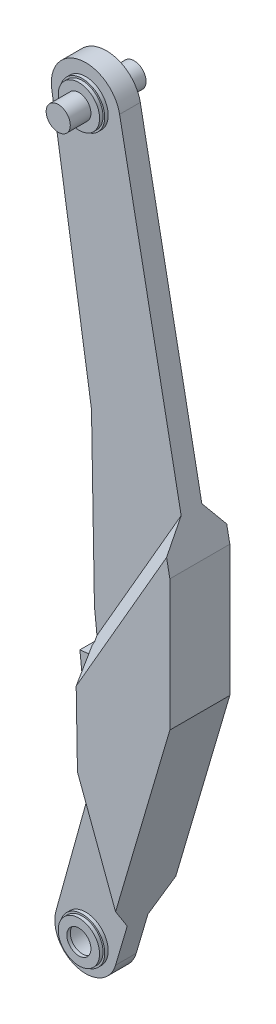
ISO-10303-21;
HEADER;
FILE_DESCRIPTION(('STEP AP214'),'2;1');
FILE_NAME('part.step','',(''),(''),'','','');
FILE_SCHEMA(('AUTOMOTIVE_DESIGN { 1 0 10303 214 1 1 1 1 }'));
ENDSEC;
DATA;
#1=APPLICATION_CONTEXT('core data for automotive mechanical design processes');
#2=APPLICATION_PROTOCOL_DEFINITION('international standard','automotive_design',2000,#1);
#3=PRODUCT_CONTEXT('',#1,'mechanical');
#4=PRODUCT('Part','Part','',(#3));
#5=PRODUCT_RELATED_PRODUCT_CATEGORY('part','',(#4));
#6=PRODUCT_DEFINITION_FORMATION('','',#4);
#7=PRODUCT_DEFINITION_CONTEXT('part definition',#1,'design');
#8=PRODUCT_DEFINITION('design','',#6,#7);
#9=PRODUCT_DEFINITION_SHAPE('','',#8);
#10=(LENGTH_UNIT() NAMED_UNIT(*) SI_UNIT(.MILLI.,.METRE.));
#11=(NAMED_UNIT(*) PLANE_ANGLE_UNIT() SI_UNIT($,.RADIAN.));
#12=(NAMED_UNIT(*) SI_UNIT($,.STERADIAN.) SOLID_ANGLE_UNIT());
#13=UNCERTAINTY_MEASURE_WITH_UNIT(LENGTH_MEASURE(1.E-05),#10,'distance_accuracy_value','');
#14=(GEOMETRIC_REPRESENTATION_CONTEXT(3) GLOBAL_UNCERTAINTY_ASSIGNED_CONTEXT((#13)) GLOBAL_UNIT_ASSIGNED_CONTEXT((#10,
#11,#12)) REPRESENTATION_CONTEXT('',''));
#15=CARTESIAN_POINT('',(0.,0.,0.));
#16=DIRECTION('',(0.,0.,1.));
#17=DIRECTION('',(1.,0.,0.));
#18=AXIS2_PLACEMENT_3D('',#15,#16,#17);
#19=CARTESIAN_POINT('',(30.4828677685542,252.569931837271,34.));
#20=DIRECTION('',(0.994521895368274,0.10452846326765,0.));
#21=DIRECTION('',(-0.10452846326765,0.994521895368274,0.));
#22=AXIS2_PLACEMENT_3D('',#19,#20,#21);
#23=PLANE('',#22);
#24=DIRECTION('',(0.10452846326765,-0.994521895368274,0.));
#25=VECTOR('',#24,1.);
#26=CARTESIAN_POINT('',(-52.7477110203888,1044.45599217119,0.));
#27=LINE('',#26,#25);
#28=CARTESIAN_POINT('',(12.5613807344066,423.081491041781,0.));
#29=VERTEX_POINT('',#28);
#30=CARTESIAN_POINT('',(16.2116507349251,388.351491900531,0.));
#31=VERTEX_POINT('',#30);
#32=EDGE_CURVE('E268',#29,#31,#27,.T.);
#33=ORIENTED_EDGE('',*,*,#32,.T.);
#34=DIRECTION('',(0.0856131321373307,-0.814554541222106,-0.573734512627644));
#35=VECTOR('',#34,1.);
#36=CARTESIAN_POINT('',(2.34765453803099,520.258604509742,92.9092640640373));
#37=LINE('',#36,#35);
#38=CARTESIAN_POINT('',(20.5390543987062,347.178996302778,-29.));
#39=VERTEX_POINT('',#38);
#40=EDGE_CURVE('E266',#31,#39,#37,.T.);
#41=ORIENTED_EDGE('',*,*,#40,.T.);
#42=DIRECTION('',(0.10452846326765,-0.994521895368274,0.));
#43=VECTOR('',#42,1.);
#44=CARTESIAN_POINT('',(30.4828677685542,252.569931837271,-29.));
#45=LINE('',#44,#43);
#46=CARTESIAN_POINT('',(30.4828677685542,252.569931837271,-29.));
#47=VERTEX_POINT('',#46);
#48=EDGE_CURVE('E244',#39,#47,#45,.T.);
#49=ORIENTED_EDGE('',*,*,#48,.T.);
#50=DIRECTION('',(0.,0.,-1.));
#51=VECTOR('',#50,1.);
#52=CARTESIAN_POINT('',(30.4828677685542,252.569931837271,34.));
#53=LINE('',#52,#51);
#54=CARTESIAN_POINT('',(30.4828677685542,252.569931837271,34.));
#55=VERTEX_POINT('',#54);
#56=EDGE_CURVE('E260',#55,#47,#53,.T.);
#57=ORIENTED_EDGE('',*,*,#56,.F.);
#58=DIRECTION('',(0.10452846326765,-0.994521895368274,0.));
#59=VECTOR('',#58,1.);
#60=CARTESIAN_POINT('',(30.4828677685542,252.569931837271,34.));
#61=LINE('',#60,#59);
#62=CARTESIAN_POINT('',(16.808533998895,382.672526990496,34.));
#63=VERTEX_POINT('',#62);
#64=EDGE_CURVE('E250',#63,#55,#61,.T.);
#65=ORIENTED_EDGE('',*,*,#64,.F.);
#66=DIRECTION('',(0.0856131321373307,-0.814554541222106,0.573734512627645));
#67=VECTOR('',#66,1.);
#68=CARTESIAN_POINT('',(17.641676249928,374.745707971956,39.583284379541));
#69=LINE('',#68,#67);
#70=CARTESIAN_POINT('',(16.2116507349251,388.351491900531,30.));
#71=VERTEX_POINT('',#70);
#72=EDGE_CURVE('E422',#63,#71,#69,.F.);
#73=ORIENTED_EDGE('',*,*,#72,.T.);
#74=DIRECTION('',(0.10452846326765,-0.994521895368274,0.));
#75=VECTOR('',#74,1.);
#76=CARTESIAN_POINT('',(-52.7477110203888,1044.45599217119,30.));
#77=LINE('',#76,#75);
#78=CARTESIAN_POINT('',(12.5613807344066,423.081491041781,30.));
#79=VERTEX_POINT('',#78);
#80=EDGE_CURVE('E259',#79,#71,#77,.T.);
#81=ORIENTED_EDGE('',*,*,#80,.F.);
#82=DIRECTION('',(0.,0.,-1.));
#83=VECTOR('',#82,1.);
#84=CARTESIAN_POINT('',(12.5613807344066,423.081491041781,34.));
#85=LINE('',#84,#83);
#86=EDGE_CURVE('E255',#79,#29,#85,.T.);
#87=ORIENTED_EDGE('',*,*,#86,.T.);
#88=EDGE_LOOP('',(#33,#41,#49,#57,#65,#73,#81,#87));
#89=FACE_BOUND('',#88,.T.);
#90=DIRECTION('',(-0.10452846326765,0.994521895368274,0.));
#91=VECTOR('',#90,1.);
#92=CARTESIAN_POINT('',(19.2983221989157,358.983774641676,28.));
#93=LINE('',#92,#91);
#94=CARTESIAN_POINT('',(29.7511685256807,259.531585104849,28.));
#95=VERTEX_POINT('',#94);
#96=CARTESIAN_POINT('',(19.2983221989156,358.983774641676,28.));
#97=VERTEX_POINT('',#96);
#98=EDGE_CURVE('E175',#95,#97,#93,.T.);
#99=ORIENTED_EDGE('',*,*,#98,.F.);
#100=DIRECTION('',(0.,0.,1.));
#101=VECTOR('',#100,1.);
#102=CARTESIAN_POINT('',(29.7511685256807,259.531585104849,28.));
#103=LINE('',#102,#101);
#104=CARTESIAN_POINT('',(29.7511685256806,259.531585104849,-12.));
#105=VERTEX_POINT('',#104);
#106=EDGE_CURVE('E177',#105,#95,#103,.T.);
#107=ORIENTED_EDGE('',*,*,#106,.F.);
#108=DIRECTION('',(0.10452846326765,-0.994521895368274,0.));
#109=VECTOR('',#108,1.);
#110=CARTESIAN_POINT('',(19.2983221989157,358.983774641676,-12.));
#111=LINE('',#110,#109);
#112=CARTESIAN_POINT('',(19.2983221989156,358.983774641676,-12.));
#113=VERTEX_POINT('',#112);
#114=EDGE_CURVE('E38',#113,#105,#111,.T.);
#115=ORIENTED_EDGE('',*,*,#114,.F.);
#116=DIRECTION('',(0.,0.,-1.));
#117=VECTOR('',#116,1.);
#118=CARTESIAN_POINT('',(19.2983221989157,358.983774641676,28.));
#119=LINE('',#118,#117);
#120=EDGE_CURVE('E33',#97,#113,#119,.T.);
#121=ORIENTED_EDGE('',*,*,#120,.F.);
#122=EDGE_LOOP('',(#99,#107,#115,#121));
#123=FACE_BOUND('',#122,.T.);
#124=ADVANCED_FACE('F16',(#89,#123),#23,.F.);
#125=CARTESIAN_POINT('',(0.,0.,-5.));
#126=DIRECTION('',(0.,0.,1.));
#127=DIRECTION('',(1.,0.,0.));
#128=AXIS2_PLACEMENT_3D('',#125,#126,#127);
#129=PLANE('',#128);
#130=CARTESIAN_POINT('',(0.,0.,-5.));
#131=DIRECTION('',(0.,0.,1.));
#132=DIRECTION('',(1.,0.,0.));
#133=AXIS2_PLACEMENT_3D('',#130,#131,#132);
#134=CIRCLE('',#133,32.5);
#135=CARTESIAN_POINT('',(32.5,0.,-5.));
#136=VERTEX_POINT('',#135);
#137=EDGE_CURVE('E307',#136,#136,#134,.T.);
#138=ORIENTED_EDGE('',*,*,#137,.F.);
#139=EDGE_LOOP('',(#138));
#140=FACE_BOUND('',#139,.T.);
#141=CARTESIAN_POINT('',(0.,0.,-5.));
#142=DIRECTION('',(0.,0.,1.));
#143=DIRECTION('',(1.,0.,0.));
#144=AXIS2_PLACEMENT_3D('',#141,#142,#143);
#145=CIRCLE('',#144,30.);
#146=CARTESIAN_POINT('',(30.,0.,-5.));
#147=VERTEX_POINT('',#146);
#148=EDGE_CURVE('E10',#147,#147,#145,.F.);
#149=ORIENTED_EDGE('',*,*,#148,.F.);
#150=EDGE_LOOP('',(#149));
#151=FACE_BOUND('',#150,.T.);
#152=ADVANCED_FACE('F450',(#140,#151),#129,.F.);
#153=CARTESIAN_POINT('',(0.,0.,35.));
#154=DIRECTION('',(0.,0.,1.));
#155=DIRECTION('',(1.,0.,0.));
#156=AXIS2_PLACEMENT_3D('',#153,#154,#155);
#157=PLANE('',#156);
#158=CARTESIAN_POINT('',(0.,0.,35.));
#159=DIRECTION('',(0.,0.,1.));
#160=DIRECTION('',(1.,0.,0.));
#161=AXIS2_PLACEMENT_3D('',#158,#159,#160);
#162=CIRCLE('',#161,32.5);
#163=CARTESIAN_POINT('',(32.5,0.,35.));
#164=VERTEX_POINT('',#163);
#165=EDGE_CURVE('E310',#164,#164,#162,.T.);
#166=ORIENTED_EDGE('',*,*,#165,.T.);
#167=EDGE_LOOP('',(#166));
#168=FACE_BOUND('',#167,.T.);
#169=CARTESIAN_POINT('',(0.,0.,35.));
#170=DIRECTION('',(0.,0.,1.));
#171=DIRECTION('',(1.,0.,0.));
#172=AXIS2_PLACEMENT_3D('',#169,#170,#171);
#173=CIRCLE('',#172,30.);
#174=CARTESIAN_POINT('',(30.,0.,35.));
#175=VERTEX_POINT('',#174);
#176=EDGE_CURVE('E211',#175,#175,#173,.T.);
#177=ORIENTED_EDGE('',*,*,#176,.F.);
#178=EDGE_LOOP('',(#177));
#179=FACE_BOUND('',#178,.T.);
#180=ADVANCED_FACE('F443',(#168,#179),#157,.T.);
#181=CARTESIAN_POINT('',(0.,1050.,-10.));
#182=DIRECTION('',(0.,0.,-1.));
#183=DIRECTION('',(-1.,0.,0.));
#184=AXIS2_PLACEMENT_3D('',#181,#182,#183);
#185=PLANE('',#184);
#186=CARTESIAN_POINT('',(0.,1050.,-10.));
#187=DIRECTION('',(0.,0.,-1.));
#188=DIRECTION('',(-1.,0.,0.));
#189=AXIS2_PLACEMENT_3D('',#186,#187,#188);
#190=CIRCLE('',#189,30.);
#191=CARTESIAN_POINT('',(-30.,1050.,-10.));
#192=VERTEX_POINT('',#191);
#193=EDGE_CURVE('E226',#192,#192,#190,.T.);
#194=ORIENTED_EDGE('',*,*,#193,.T.);
#195=EDGE_LOOP('',(#194));
#196=FACE_BOUND('',#195,.T.);
#197=CARTESIAN_POINT('',(0.,1050.,-10.));
#198=DIRECTION('',(0.,0.,-1.));
#199=DIRECTION('',(-1.,0.,0.));
#200=AXIS2_PLACEMENT_3D('',#197,#198,#199);
#201=CIRCLE('',#200,17.5);
#202=CARTESIAN_POINT('',(-17.5,1050.,-10.));
#203=VERTEX_POINT('',#202);
#204=EDGE_CURVE('E220',#203,#203,#201,.T.);
#205=ORIENTED_EDGE('',*,*,#204,.F.);
#206=EDGE_LOOP('',(#205));
#207=FACE_BOUND('',#206,.T.);
#208=ADVANCED_FACE('F432',(#196,#207),#185,.T.);
#209=CARTESIAN_POINT('',(0.,1050.,-5.));
#210=DIRECTION('',(0.,0.,1.));
#211=DIRECTION('',(1.,0.,0.));
#212=AXIS2_PLACEMENT_3D('',#209,#210,#211);
#213=PLANE('',#212);
#214=CARTESIAN_POINT('',(0.,1050.,-5.));
#215=DIRECTION('',(0.,0.,1.));
#216=DIRECTION('',(1.,0.,0.));
#217=AXIS2_PLACEMENT_3D('',#214,#215,#216);
#218=CIRCLE('',#217,32.5);
#219=CARTESIAN_POINT('',(32.5,1050.,-5.));
#220=VERTEX_POINT('',#219);
#221=EDGE_CURVE('E322',#220,#220,#218,.T.);
#222=ORIENTED_EDGE('',*,*,#221,.F.);
#223=EDGE_LOOP('',(#222));
#224=FACE_BOUND('',#223,.T.);
#225=CARTESIAN_POINT('',(0.,1050.,-5.));
#226=DIRECTION('',(0.,0.,1.));
#227=DIRECTION('',(1.,0.,0.));
#228=AXIS2_PLACEMENT_3D('',#225,#226,#227);
#229=CIRCLE('',#228,30.);
#230=CARTESIAN_POINT('',(30.,1050.,-5.));
#231=VERTEX_POINT('',#230);
#232=EDGE_CURVE('E26',#231,#231,#229,.F.);
#233=ORIENTED_EDGE('',*,*,#232,.F.);
#234=EDGE_LOOP('',(#233));
#235=FACE_BOUND('',#234,.T.);
#236=ADVANCED_FACE('F429',(#224,#235),#213,.F.);
#237=CARTESIAN_POINT('',(0.,1050.,40.));
#238=DIRECTION('',(0.,0.,1.));
#239=DIRECTION('',(1.,0.,0.));
#240=AXIS2_PLACEMENT_3D('',#237,#238,#239);
#241=PLANE('',#240);
#242=CARTESIAN_POINT('',(0.,1050.,40.));
#243=DIRECTION('',(0.,0.,1.));
#244=DIRECTION('',(1.,0.,0.));
#245=AXIS2_PLACEMENT_3D('',#242,#243,#244);
#246=CIRCLE('',#245,30.);
#247=CARTESIAN_POINT('',(30.,1050.,40.));
#248=VERTEX_POINT('',#247);
#249=EDGE_CURVE('E238',#248,#248,#246,.T.);
#250=ORIENTED_EDGE('',*,*,#249,.T.);
#251=EDGE_LOOP('',(#250));
#252=FACE_BOUND('',#251,.T.);
#253=CARTESIAN_POINT('',(0.,1050.,40.));
#254=DIRECTION('',(0.,0.,1.));
#255=DIRECTION('',(1.,0.,0.));
#256=AXIS2_PLACEMENT_3D('',#253,#254,#255);
#257=CIRCLE('',#256,17.5);
#258=CARTESIAN_POINT('',(17.5,1050.,40.));
#259=VERTEX_POINT('',#258);
#260=EDGE_CURVE('E229',#259,#259,#257,.T.);
#261=ORIENTED_EDGE('',*,*,#260,.F.);
#262=EDGE_LOOP('',(#261));
#263=FACE_BOUND('',#262,.T.);
#264=ADVANCED_FACE('F431',(#252,#263),#241,.T.);
#265=CARTESIAN_POINT('',(0.,1050.,35.));
#266=DIRECTION('',(0.,0.,1.));
#267=DIRECTION('',(1.,0.,0.));
#268=AXIS2_PLACEMENT_3D('',#265,#266,#267);
#269=PLANE('',#268);
#270=CARTESIAN_POINT('',(0.,1050.,35.));
#271=DIRECTION('',(0.,0.,1.));
#272=DIRECTION('',(1.,0.,0.));
#273=AXIS2_PLACEMENT_3D('',#270,#271,#272);
#274=CIRCLE('',#273,32.5);
#275=CARTESIAN_POINT('',(32.5,1050.,35.));
#276=VERTEX_POINT('',#275);
#277=EDGE_CURVE('E325',#276,#276,#274,.T.);
#278=ORIENTED_EDGE('',*,*,#277,.T.);
#279=EDGE_LOOP('',(#278));
#280=FACE_BOUND('',#279,.T.);
#281=CARTESIAN_POINT('',(0.,1050.,35.));
#282=DIRECTION('',(0.,0.,1.));
#283=DIRECTION('',(1.,0.,0.));
#284=AXIS2_PLACEMENT_3D('',#281,#282,#283);
#285=CIRCLE('',#284,30.);
#286=CARTESIAN_POINT('',(30.,1050.,35.));
#287=VERTEX_POINT('',#286);
#288=EDGE_CURVE('E235',#287,#287,#285,.T.);
#289=ORIENTED_EDGE('',*,*,#288,.F.);
#290=EDGE_LOOP('',(#289));
#291=FACE_BOUND('',#290,.T.);
#292=ADVANCED_FACE('F440',(#280,#291),#269,.T.);
#293=CARTESIAN_POINT('',(8.27747138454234,668.506493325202,30.));
#294=DIRECTION('',(0.999847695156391,0.0174524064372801,0.));
#295=DIRECTION('',(-0.0174524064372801,0.999847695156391,0.));
#296=AXIS2_PLACEMENT_3D('',#293,#294,#295);
#297=PLANE('',#296);
#298=DIRECTION('',(0.0174524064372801,-0.999847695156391,0.));
#299=VECTOR('',#298,1.);
#300=CARTESIAN_POINT('',(8.27747138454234,668.506493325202,0.));
#301=LINE('',#300,#299);
#302=CARTESIAN_POINT('',(8.27747138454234,668.506493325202,0.));
#303=VERTEX_POINT('',#302);
#304=EDGE_CURVE('E337',#303,#29,#301,.T.);
#305=ORIENTED_EDGE('',*,*,#304,.T.);
#306=ORIENTED_EDGE('',*,*,#86,.F.);
#307=DIRECTION('',(0.0174524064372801,-0.999847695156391,0.));
#308=VECTOR('',#307,1.);
#309=CARTESIAN_POINT('',(8.27747138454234,668.506493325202,30.));
#310=LINE('',#309,#308);
#311=CARTESIAN_POINT('',(8.27747138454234,668.506493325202,30.));
#312=VERTEX_POINT('',#311);
#313=EDGE_CURVE('E354',#312,#79,#310,.T.);
#314=ORIENTED_EDGE('',*,*,#313,.F.);
#315=DIRECTION('',(0.,0.,-1.));
#316=VECTOR('',#315,1.);
#317=CARTESIAN_POINT('',(8.27747138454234,668.506493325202,30.));
#318=LINE('',#317,#316);
#319=EDGE_CURVE('E377',#312,#303,#318,.T.);
#320=ORIENTED_EDGE('',*,*,#319,.T.);
#321=EDGE_LOOP('',(#305,#306,#314,#320));
#322=FACE_BOUND('',#321,.T.);
#323=ADVANCED_FACE('F605',(#322),#297,.F.);
#324=CARTESIAN_POINT('',(0.,1050.,30.));
#325=DIRECTION('',(0.,0.,-1.));
#326=DIRECTION('',(-1.,0.,0.));
#327=AXIS2_PLACEMENT_3D('',#324,#325,#326);
#328=PLANE('',#327);
#329=CARTESIAN_POINT('',(0.,0.,30.));
#330=DIRECTION('',(0.,0.,-1.));
#331=DIRECTION('',(-1.,0.,0.));
#332=AXIS2_PLACEMENT_3D('',#329,#330,#331);
#333=CIRCLE('',#332,32.5);
#334=CARTESIAN_POINT('',(-32.5,0.,30.));
#335=VERTEX_POINT('',#334);
#336=EDGE_CURVE('E314',#335,#335,#333,.F.);
#337=ORIENTED_EDGE('',*,*,#336,.F.);
#338=EDGE_LOOP('',(#337));
#339=FACE_BOUND('',#338,.T.);
#340=DIRECTION('',(0.282341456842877,0.959313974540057,0.));
#341=VECTOR('',#340,1.);
#342=CARTESIAN_POINT('',(172.2522140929,425.881333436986,30.));
#343=LINE('',#342,#341);
#344=CARTESIAN_POINT('',(43.1691288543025,-12.7053655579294,30.));
#345=VERTEX_POINT('',#344);
#346=CARTESIAN_POINT('',(60.1527415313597,45.,30.));
#347=VERTEX_POINT('',#346);
#348=EDGE_CURVE('E361',#345,#347,#343,.T.);
#349=ORIENTED_EDGE('',*,*,#348,.T.);
#350=DIRECTION('',(-0.349902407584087,0.936786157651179,0.));
#351=VECTOR('',#350,1.);
#352=CARTESIAN_POINT('',(-276.634511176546,946.673236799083,30.));
#353=LINE('',#352,#351);
#354=CARTESIAN_POINT('',(5.99326374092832,190.,30.));
#355=VERTEX_POINT('',#354);
#356=EDGE_CURVE('E302',#347,#355,#353,.T.);
#357=ORIENTED_EDGE('',*,*,#356,.T.);
#358=DIRECTION('',(-0.267238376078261,-0.963630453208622,0.));
#359=VECTOR('',#358,1.);
#360=CARTESIAN_POINT('',(16.,226.083125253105,30.));
#361=LINE('',#360,#359);
#362=CARTESIAN_POINT('',(-43.3633703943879,12.0257269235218,30.));
#363=VERTEX_POINT('',#362);
#364=EDGE_CURVE('E357',#355,#363,#361,.T.);
#365=ORIENTED_EDGE('',*,*,#364,.T.);
#366=CARTESIAN_POINT('',(0.,0.,30.));
#367=DIRECTION('',(0.,0.,1.));
#368=DIRECTION('',(1.,0.,0.));
#369=AXIS2_PLACEMENT_3D('',#366,#367,#368);
#370=CIRCLE('',#369,45.);
#371=EDGE_CURVE('E359',#363,#345,#370,.T.);
#372=ORIENTED_EDGE('',*,*,#371,.T.);
#373=EDGE_LOOP('',(#349,#357,#365,#372));
#374=FACE_BOUND('',#373,.T.);
#375=ADVANCED_FACE('F638',(#339,#374),#328,.F.);
#376=CARTESIAN_POINT('',(0.,1050.,0.));
#377=DIRECTION('',(0.,0.,-1.));
#378=DIRECTION('',(-1.,0.,0.));
#379=AXIS2_PLACEMENT_3D('',#376,#377,#378);
#380=PLANE('',#379);
#381=DIRECTION('',(-0.349902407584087,0.936786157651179,0.));
#382=VECTOR('',#381,1.);
#383=CARTESIAN_POINT('',(-276.634511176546,946.673236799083,0.));
#384=LINE('',#383,#382);
#385=CARTESIAN_POINT('',(60.1527415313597,45.,0.));
#386=VERTEX_POINT('',#385);
#387=CARTESIAN_POINT('',(5.99326374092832,190.,0.));
#388=VERTEX_POINT('',#387);
#389=EDGE_CURVE('E299',#386,#388,#384,.T.);
#390=ORIENTED_EDGE('',*,*,#389,.F.);
#391=DIRECTION('',(0.282341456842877,0.959313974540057,0.));
#392=VECTOR('',#391,1.);
#393=CARTESIAN_POINT('',(172.2522140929,425.881333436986,0.));
#394=LINE('',#393,#392);
#395=CARTESIAN_POINT('',(43.1691288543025,-12.7053655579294,0.));
#396=VERTEX_POINT('',#395);
#397=EDGE_CURVE('E344',#396,#386,#394,.T.);
#398=ORIENTED_EDGE('',*,*,#397,.F.);
#399=CARTESIAN_POINT('',(0.,0.,0.));
#400=DIRECTION('',(0.,0.,1.));
#401=DIRECTION('',(1.,0.,0.));
#402=AXIS2_PLACEMENT_3D('',#399,#400,#401);
#403=CIRCLE('',#402,45.);
#404=CARTESIAN_POINT('',(-43.3633703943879,12.0257269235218,0.));
#405=VERTEX_POINT('',#404);
#406=EDGE_CURVE('E342',#405,#396,#403,.T.);
#407=ORIENTED_EDGE('',*,*,#406,.F.);
#408=DIRECTION('',(-0.267238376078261,-0.963630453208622,0.));
#409=VECTOR('',#408,1.);
#410=CARTESIAN_POINT('',(16.,226.083125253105,0.));
#411=LINE('',#410,#409);
#412=EDGE_CURVE('E340',#388,#405,#411,.T.);
#413=ORIENTED_EDGE('',*,*,#412,.F.);
#414=EDGE_LOOP('',(#390,#398,#407,#413));
#415=FACE_BOUND('',#414,.T.);
#416=CARTESIAN_POINT('',(0.,0.,0.));
#417=DIRECTION('',(0.,0.,-1.));
#418=DIRECTION('',(-1.,0.,0.));
#419=AXIS2_PLACEMENT_3D('',#416,#417,#418);
#420=CIRCLE('',#419,32.5);
#421=CARTESIAN_POINT('',(-32.5,0.,0.));
#422=VERTEX_POINT('',#421);
#423=EDGE_CURVE('E313',#422,#422,#420,.F.);
#424=ORIENTED_EDGE('',*,*,#423,.T.);
#425=EDGE_LOOP('',(#424));
#426=FACE_BOUND('',#425,.T.);
#427=ADVANCED_FACE('F648',(#415,#426),#380,.T.);
#428=CARTESIAN_POINT('',(0.,1050.,30.));
#429=DIRECTION('',(0.,0.,-1.));
#430=DIRECTION('',(-1.,0.,0.));
#431=AXIS2_PLACEMENT_3D('',#428,#429,#430);
#432=CIRCLE('',#431,32.5);
#433=CARTESIAN_POINT('',(-32.5,1050.,30.));
#434=VERTEX_POINT('',#433);
#435=EDGE_CURVE('E318',#434,#434,#432,.F.);
#436=ORIENTED_EDGE('',*,*,#435,.F.);
#437=EDGE_LOOP('',(#436));
#438=FACE_BOUND('',#437,.T.);
#439=ORIENTED_EDGE('',*,*,#313,.T.);
#440=ORIENTED_EDGE('',*,*,#80,.T.);
#441=DIRECTION('',(0.5,0.866025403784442,0.));
#442=VECTOR('',#441,1.);
#443=CARTESIAN_POINT('',(298.660946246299,877.568022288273,30.));
#444=LINE('',#443,#442);
#445=CARTESIAN_POINT('',(138.406973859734,600.,30.));
#446=VERTEX_POINT('',#445);
#447=EDGE_CURVE('E297',#71,#446,#444,.T.);
#448=ORIENTED_EDGE('',*,*,#447,.T.);
#449=DIRECTION('',(-0.190808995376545,0.981627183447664,0.));
#450=VECTOR('',#449,1.);
#451=CARTESIAN_POINT('',(49.0813591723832,1059.54044976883,30.));
#452=LINE('',#451,#450);
#453=CARTESIAN_POINT('',(49.0813591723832,1059.54044976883,30.));
#454=VERTEX_POINT('',#453);
#455=EDGE_CURVE('E364',#446,#454,#452,.T.);
#456=ORIENTED_EDGE('',*,*,#455,.T.);
#457=CARTESIAN_POINT('',(0.,1050.,30.));
#458=DIRECTION('',(0.,0.,1.));
#459=DIRECTION('',(-1.,0.,0.));
#460=AXIS2_PLACEMENT_3D('',#457,#458,#459);
#461=CIRCLE('',#460,50.);
#462=CARTESIAN_POINT('',(-49.4151151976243,1042.37462197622,30.));
#463=VERTEX_POINT('',#462);
#464=EDGE_CURVE('E349',#454,#463,#461,.T.);
#465=ORIENTED_EDGE('',*,*,#464,.T.);
#466=DIRECTION('',(0.15250756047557,-0.988302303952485,0.));
#467=VECTOR('',#466,1.);
#468=CARTESIAN_POINT('',(-49.4151151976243,1042.37462197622,30.));
#469=LINE('',#468,#467);
#470=EDGE_CURVE('E352',#463,#312,#469,.T.);
#471=ORIENTED_EDGE('',*,*,#470,.T.);
#472=EDGE_LOOP('',(#439,#440,#448,#456,#465,#471));
#473=FACE_BOUND('',#472,.T.);
#474=ADVANCED_FACE('F588',(#438,#473),#328,.F.);
#475=ORIENTED_EDGE('',*,*,#32,.F.);
#476=ORIENTED_EDGE('',*,*,#304,.F.);
#477=DIRECTION('',(0.15250756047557,-0.988302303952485,0.));
#478=VECTOR('',#477,1.);
#479=CARTESIAN_POINT('',(-49.4151151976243,1042.37462197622,0.));
#480=LINE('',#479,#478);
#481=CARTESIAN_POINT('',(-49.4151151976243,1042.37462197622,0.));
#482=VERTEX_POINT('',#481);
#483=EDGE_CURVE('E335',#482,#303,#480,.T.);
#484=ORIENTED_EDGE('',*,*,#483,.F.);
#485=CARTESIAN_POINT('',(0.,1050.,0.));
#486=DIRECTION('',(0.,0.,1.));
#487=DIRECTION('',(-1.,0.,0.));
#488=AXIS2_PLACEMENT_3D('',#485,#486,#487);
#489=CIRCLE('',#488,50.);
#490=CARTESIAN_POINT('',(49.0813591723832,1059.54044976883,0.));
#491=VERTEX_POINT('',#490);
#492=EDGE_CURVE('E332',#491,#482,#489,.T.);
#493=ORIENTED_EDGE('',*,*,#492,.F.);
#494=DIRECTION('',(-0.190808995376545,0.981627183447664,0.));
#495=VECTOR('',#494,1.);
#496=CARTESIAN_POINT('',(49.0813591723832,1059.54044976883,0.));
#497=LINE('',#496,#495);
#498=CARTESIAN_POINT('',(138.406973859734,600.,0.));
#499=VERTEX_POINT('',#498);
#500=EDGE_CURVE('E347',#499,#491,#497,.T.);
#501=ORIENTED_EDGE('',*,*,#500,.F.);
#502=DIRECTION('',(0.5,0.866025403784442,0.));
#503=VECTOR('',#502,1.);
#504=CARTESIAN_POINT('',(298.660946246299,877.568022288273,0.));
#505=LINE('',#504,#503);
#506=EDGE_CURVE('E295',#31,#499,#505,.T.);
#507=ORIENTED_EDGE('',*,*,#506,.F.);
#508=EDGE_LOOP('',(#475,#476,#484,#493,#501,#507));
#509=FACE_BOUND('',#508,.T.);
#510=CARTESIAN_POINT('',(0.,1050.,0.));
#511=DIRECTION('',(0.,0.,-1.));
#512=DIRECTION('',(-1.,0.,0.));
#513=AXIS2_PLACEMENT_3D('',#510,#511,#512);
#514=CIRCLE('',#513,32.5);
#515=CARTESIAN_POINT('',(-32.5,1050.,0.));
#516=VERTEX_POINT('',#515);
#517=EDGE_CURVE('E328',#516,#516,#514,.F.);
#518=ORIENTED_EDGE('',*,*,#517,.T.);
#519=EDGE_LOOP('',(#518));
#520=FACE_BOUND('',#519,.T.);
#521=ADVANCED_FACE('F610',(#509,#520),#380,.T.);
#522=CARTESIAN_POINT('',(0.,1050.,30.));
#523=DIRECTION('',(0.,0.,-1.));
#524=DIRECTION('',(-1.,0.,0.));
#525=AXIS2_PLACEMENT_3D('',#522,#523,#524);
#526=CYLINDRICAL_SURFACE('',#525,50.);
#527=ORIENTED_EDGE('',*,*,#492,.T.);
#528=DIRECTION('',(0.,0.,-1.));
#529=VECTOR('',#528,1.);
#530=CARTESIAN_POINT('',(-49.4151151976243,1042.37462197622,30.));
#531=LINE('',#530,#529);
#532=EDGE_CURVE('E331',#463,#482,#531,.T.);
#533=ORIENTED_EDGE('',*,*,#532,.F.);
#534=ORIENTED_EDGE('',*,*,#464,.F.);
#535=DIRECTION('',(0.,0.,-1.));
#536=VECTOR('',#535,1.);
#537=CARTESIAN_POINT('',(49.0813591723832,1059.54044976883,30.));
#538=LINE('',#537,#536);
#539=EDGE_CURVE('E366',#454,#491,#538,.T.);
#540=ORIENTED_EDGE('',*,*,#539,.T.);
#541=EDGE_LOOP('',(#527,#533,#534,#540));
#542=FACE_BOUND('',#541,.T.);
#543=ADVANCED_FACE('F18',(#542),#526,.T.);
#544=CARTESIAN_POINT('',(-49.4151151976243,1042.37462197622,30.));
#545=DIRECTION('',(0.988302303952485,0.15250756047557,0.));
#546=DIRECTION('',(-0.15250756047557,0.988302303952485,0.));
#547=AXIS2_PLACEMENT_3D('',#544,#545,#546);
#548=PLANE('',#547);
#549=ORIENTED_EDGE('',*,*,#483,.T.);
#550=ORIENTED_EDGE('',*,*,#319,.F.);
#551=ORIENTED_EDGE('',*,*,#470,.F.);
#552=ORIENTED_EDGE('',*,*,#532,.T.);
#553=EDGE_LOOP('',(#549,#550,#551,#552));
#554=FACE_BOUND('',#553,.T.);
#555=ADVANCED_FACE('F601',(#554),#548,.F.);
#556=DIRECTION('',(-0.0174524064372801,0.999847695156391,0.));
#557=VECTOR('',#556,1.);
#558=CARTESIAN_POINT('',(15.8638940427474,233.880630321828,34.));
#559=LINE('',#558,#557);
#560=CARTESIAN_POINT('',(15.8638940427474,233.880630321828,34.));
#561=VERTEX_POINT('',#560);
#562=CARTESIAN_POINT('',(13.3706592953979,376.717953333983,34.));
#563=VERTEX_POINT('',#562);
#564=EDGE_CURVE('E248',#561,#563,#559,.T.);
#565=ORIENTED_EDGE('',*,*,#564,.F.);
#566=DIRECTION('',(0.,0.,-1.));
#567=VECTOR('',#566,1.);
#568=CARTESIAN_POINT('',(15.8638940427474,233.880630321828,34.));
#569=LINE('',#568,#567);
#570=CARTESIAN_POINT('',(15.8638940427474,233.880630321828,-29.));
#571=VERTEX_POINT('',#570);
#572=EDGE_CURVE('E256',#561,#571,#569,.T.);
#573=ORIENTED_EDGE('',*,*,#572,.T.);
#574=DIRECTION('',(0.0174524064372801,-0.999847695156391,0.));
#575=VECTOR('',#574,1.);
#576=CARTESIAN_POINT('',(13.2569255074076,383.233757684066,-29.));
#577=LINE('',#576,#575);
#578=CARTESIAN_POINT('',(15.8778517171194,233.080995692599,-29.));
#579=VERTEX_POINT('',#578);
#580=EDGE_CURVE('E290',#571,#579,#577,.T.);
#581=ORIENTED_EDGE('',*,*,#580,.T.);
#582=DIRECTION('',(0.0162183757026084,-0.929150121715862,0.369346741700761));
#583=VECTOR('',#582,1.);
#584=CARTESIAN_POINT('',(18.8974635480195,60.0875497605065,39.7666762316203));
#585=LINE('',#584,#583);
#586=CARTESIAN_POINT('',(16.,226.083125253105,-26.2182744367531));
#587=VERTEX_POINT('',#586);
#588=EDGE_CURVE('E317',#579,#587,#585,.T.);
#589=ORIENTED_EDGE('',*,*,#588,.T.);
#590=DIRECTION('',(0.,0.,-1.));
#591=VECTOR('',#590,1.);
#592=CARTESIAN_POINT('',(16.,226.083125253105,30.));
#593=LINE('',#592,#591);
#594=CARTESIAN_POINT('',(16.,226.083125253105,56.2182744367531));
#595=VERTEX_POINT('',#594);
#596=EDGE_CURVE('E375',#595,#587,#593,.T.);
#597=ORIENTED_EDGE('',*,*,#596,.F.);
#598=DIRECTION('',(0.0162183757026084,-0.929150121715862,-0.369346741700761));
#599=VECTOR('',#598,1.);
#600=CARTESIAN_POINT('',(12.9478287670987,400.941898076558,125.726437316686));
#601=LINE('',#600,#599);
#602=CARTESIAN_POINT('',(15.9217626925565,230.565337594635,58.));
#603=VERTEX_POINT('',#602);
#604=EDGE_CURVE('E406',#595,#603,#601,.F.);
#605=ORIENTED_EDGE('',*,*,#604,.T.);
#606=DIRECTION('',(0.0174524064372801,-0.999847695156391,0.));
#607=VECTOR('',#606,1.);
#608=CARTESIAN_POINT('',(13.2569255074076,383.233757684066,58.));
#609=LINE('',#608,#607);
#610=CARTESIAN_POINT('',(14.0530620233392,337.623127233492,58.));
#611=VERTEX_POINT('',#610);
#612=EDGE_CURVE('E281',#611,#603,#609,.T.);
#613=ORIENTED_EDGE('',*,*,#612,.F.);
#614=DIRECTION('',(0.0148740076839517,-0.852131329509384,0.523116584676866));
#615=VECTOR('',#614,1.);
#616=CARTESIAN_POINT('',(13.3889667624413,375.669119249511,34.6438708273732));
#617=LINE('',#616,#615);
#618=EDGE_CURVE('E408',#611,#563,#617,.F.);
#619=ORIENTED_EDGE('',*,*,#618,.T.);
#620=EDGE_LOOP('',(#565,#573,#581,#589,#597,#605,#613,#619));
#621=FACE_BOUND('',#620,.T.);
#622=ADVANCED_FACE('F620',(#621),#297,.F.);
#623=CARTESIAN_POINT('',(16.,226.083125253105,30.));
#624=DIRECTION('',(0.963630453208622,-0.267238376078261,0.));
#625=DIRECTION('',(0.267238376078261,0.963630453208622,0.));
#626=AXIS2_PLACEMENT_3D('',#623,#624,#625);
#627=PLANE('',#626);
#628=ORIENTED_EDGE('',*,*,#364,.F.);
#629=DIRECTION('',(-0.21891156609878,-0.789369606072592,-0.573561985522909));
#630=VECTOR('',#629,1.);
#631=CARTESIAN_POINT('',(47.3665592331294,339.187283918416,138.400620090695));
#632=LINE('',#631,#630);
#633=EDGE_CURVE('E416',#355,#595,#632,.F.);
#634=ORIENTED_EDGE('',*,*,#633,.T.);
#635=ORIENTED_EDGE('',*,*,#596,.T.);
#636=DIRECTION('',(-0.21891156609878,-0.789369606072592,0.573561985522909));
#637=VECTOR('',#636,1.);
#638=CARTESIAN_POINT('',(-16.4676007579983,109.008739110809,58.8488688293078));
#639=LINE('',#638,#637);
#640=EDGE_CURVE('E398',#587,#388,#639,.T.);
#641=ORIENTED_EDGE('',*,*,#640,.T.);
#642=ORIENTED_EDGE('',*,*,#412,.T.);
#643=DIRECTION('',(0.,0.,-1.));
#644=VECTOR('',#643,1.);
#645=CARTESIAN_POINT('',(-43.3633703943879,12.0257269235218,30.));
#646=LINE('',#645,#644);
#647=EDGE_CURVE('E372',#363,#405,#646,.T.);
#648=ORIENTED_EDGE('',*,*,#647,.F.);
#649=EDGE_LOOP('',(#628,#634,#635,#641,#642,#648));
#650=FACE_BOUND('',#649,.T.);
#651=ADVANCED_FACE('F651',(#650),#627,.F.);
#652=CARTESIAN_POINT('',(0.,0.,30.));
#653=DIRECTION('',(0.,0.,-1.));
#654=DIRECTION('',(-1.,0.,0.));
#655=AXIS2_PLACEMENT_3D('',#652,#653,#654);
#656=CYLINDRICAL_SURFACE('',#655,45.);
#657=ORIENTED_EDGE('',*,*,#406,.T.);
#658=DIRECTION('',(0.,0.,-1.));
#659=VECTOR('',#658,1.);
#660=CARTESIAN_POINT('',(43.1691288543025,-12.7053655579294,30.));
#661=LINE('',#660,#659);
#662=EDGE_CURVE('E369',#345,#396,#661,.T.);
#663=ORIENTED_EDGE('',*,*,#662,.F.);
#664=ORIENTED_EDGE('',*,*,#371,.F.);
#665=ORIENTED_EDGE('',*,*,#647,.T.);
#666=EDGE_LOOP('',(#657,#663,#664,#665));
#667=FACE_BOUND('',#666,.T.);
#668=ADVANCED_FACE('F644',(#667),#656,.T.);
#669=CARTESIAN_POINT('',(172.2522140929,425.881333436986,30.));
#670=DIRECTION('',(-0.959313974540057,0.282341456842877,0.));
#671=DIRECTION('',(-0.282341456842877,-0.959313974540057,0.));
#672=AXIS2_PLACEMENT_3D('',#669,#670,#671);
#673=PLANE('',#672);
#674=DIRECTION('',(0.282341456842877,0.959313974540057,0.));
#675=VECTOR('',#674,1.);
#676=CARTESIAN_POINT('',(60.1527415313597,45.,-29.));
#677=LINE('',#676,#675);
#678=CARTESIAN_POINT('',(71.6004681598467,83.8960383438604,-29.));
#679=VERTEX_POINT('',#678);
#680=CARTESIAN_POINT('',(150.,350.274795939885,-29.));
#681=VERTEX_POINT('',#680);
#682=EDGE_CURVE('E292',#679,#681,#677,.T.);
#683=ORIENTED_EDGE('',*,*,#682,.T.);
#684=DIRECTION('',(0.,0.,1.));
#685=VECTOR('',#684,1.);
#686=CARTESIAN_POINT('',(150.,350.274795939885,30.));
#687=LINE('',#686,#685);
#688=CARTESIAN_POINT('',(150.,350.274795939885,58.));
#689=VERTEX_POINT('',#688);
#690=EDGE_CURVE('E276',#681,#689,#687,.T.);
#691=ORIENTED_EDGE('',*,*,#690,.T.);
#692=DIRECTION('',(0.282341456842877,0.959313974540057,0.));
#693=VECTOR('',#692,1.);
#694=CARTESIAN_POINT('',(60.1527415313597,45.,58.));
#695=LINE('',#694,#693);
#696=CARTESIAN_POINT('',(71.205718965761,82.5547956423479,58.));
#697=VERTEX_POINT('',#696);
#698=EDGE_CURVE('E284',#697,#689,#695,.T.);
#699=ORIENTED_EDGE('',*,*,#698,.F.);
#700=DIRECTION('',(0.229646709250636,0.780272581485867,0.581753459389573));
#701=VECTOR('',#700,1.);
#702=CARTESIAN_POINT('',(126.083050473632,269.011972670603,197.018223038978));
#703=LINE('',#702,#701);
#704=EDGE_CURVE('E414',#697,#347,#703,.F.);
#705=ORIENTED_EDGE('',*,*,#704,.T.);
#706=ORIENTED_EDGE('',*,*,#348,.F.);
#707=ORIENTED_EDGE('',*,*,#662,.T.);
#708=ORIENTED_EDGE('',*,*,#397,.T.);
#709=DIRECTION('',(0.229646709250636,0.780272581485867,-0.581753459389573));
#710=VECTOR('',#709,1.);
#711=CARTESIAN_POINT('',(60.1527415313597,45.,1.38777878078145E-13));
#712=LINE('',#711,#710);
#713=EDGE_CURVE('E396',#386,#679,#712,.T.);
#714=ORIENTED_EDGE('',*,*,#713,.T.);
#715=EDGE_LOOP('',(#683,#691,#699,#705,#706,#707,#708,#714));
#716=FACE_BOUND('',#715,.T.);
#717=ADVANCED_FACE('F626',(#716),#673,.F.);
#718=CARTESIAN_POINT('',(49.0813591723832,1059.54044976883,30.));
#719=DIRECTION('',(-0.981627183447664,-0.190808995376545,0.));
#720=DIRECTION('',(0.190808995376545,-0.981627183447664,0.));
#721=AXIS2_PLACEMENT_3D('',#718,#719,#720);
#722=PLANE('',#721);
#723=DIRECTION('',(-0.190808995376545,0.981627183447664,0.));
#724=VECTOR('',#723,1.);
#725=CARTESIAN_POINT('',(162.949370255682,473.740316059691,58.));
#726=LINE('',#725,#724);
#727=CARTESIAN_POINT('',(150.,540.359050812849,58.));
#728=VERTEX_POINT('',#727);
#729=CARTESIAN_POINT('',(145.240226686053,564.84596173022,58.));
#730=VERTEX_POINT('',#729);
#731=EDGE_CURVE('E279',#728,#730,#726,.T.);
#732=ORIENTED_EDGE('',*,*,#731,.F.);
#733=DIRECTION('',(0.,0.,-1.));
#734=VECTOR('',#733,1.);
#735=CARTESIAN_POINT('',(150.,540.359050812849,30.));
#736=LINE('',#735,#734);
#737=CARTESIAN_POINT('',(150.,540.359050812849,-29.));
#738=VERTEX_POINT('',#737);
#739=EDGE_CURVE('E273',#728,#738,#736,.T.);
#740=ORIENTED_EDGE('',*,*,#739,.T.);
#741=DIRECTION('',(-0.190808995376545,0.981627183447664,0.));
#742=VECTOR('',#741,1.);
#743=CARTESIAN_POINT('',(162.949370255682,473.740316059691,-29.));
#744=LINE('',#743,#742);
#745=CARTESIAN_POINT('',(145.484271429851,563.590460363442,-29.));
#746=VERTEX_POINT('',#745);
#747=EDGE_CURVE('E287',#738,#746,#744,.T.);
#748=ORIENTED_EDGE('',*,*,#747,.T.);
#749=DIRECTION('',(-0.150317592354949,0.773316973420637,0.615942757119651));
#750=VECTOR('',#749,1.);
#751=CARTESIAN_POINT('',(138.406973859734,600.,1.38777878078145E-13));
#752=LINE('',#751,#750);
#753=EDGE_CURVE('E393',#746,#499,#752,.T.);
#754=ORIENTED_EDGE('',*,*,#753,.T.);
#755=ORIENTED_EDGE('',*,*,#500,.T.);
#756=ORIENTED_EDGE('',*,*,#539,.F.);
#757=ORIENTED_EDGE('',*,*,#455,.F.);
#758=DIRECTION('',(-0.150317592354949,0.773316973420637,-0.615942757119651));
#759=VECTOR('',#758,1.);
#760=CARTESIAN_POINT('',(163.226935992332,472.312364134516,131.702506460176));
#761=LINE('',#760,#759);
#762=EDGE_CURVE('E411',#446,#730,#761,.F.);
#763=ORIENTED_EDGE('',*,*,#762,.T.);
#764=EDGE_LOOP('',(#732,#740,#748,#754,#755,#756,#757,#763));
#765=FACE_BOUND('',#764,.T.);
#766=ADVANCED_FACE('F592',(#765),#722,.F.);
#767=CARTESIAN_POINT('',(0.,1050.,35.));
#768=DIRECTION('',(0.,0.,-1.));
#769=DIRECTION('',(-1.,0.,0.));
#770=AXIS2_PLACEMENT_3D('',#767,#768,#769);
#771=CYLINDRICAL_SURFACE('',#770,32.5);
#772=ORIENTED_EDGE('',*,*,#517,.F.);
#773=EDGE_LOOP('',(#772));
#774=FACE_BOUND('',#773,.T.);
#775=ORIENTED_EDGE('',*,*,#221,.T.);
#776=EDGE_LOOP('',(#775));
#777=FACE_BOUND('',#776,.T.);
#778=ADVANCED_FACE('F502',(#774,#777),#771,.T.);
#779=ORIENTED_EDGE('',*,*,#277,.F.);
#780=EDGE_LOOP('',(#779));
#781=FACE_BOUND('',#780,.T.);
#782=ORIENTED_EDGE('',*,*,#435,.T.);
#783=EDGE_LOOP('',(#782));
#784=FACE_BOUND('',#783,.T.);
#785=ADVANCED_FACE('F495',(#781,#784),#771,.T.);
#786=CARTESIAN_POINT('',(0.,0.,35.));
#787=DIRECTION('',(0.,0.,-1.));
#788=DIRECTION('',(-1.,0.,0.));
#789=AXIS2_PLACEMENT_3D('',#786,#787,#788);
#790=CYLINDRICAL_SURFACE('',#789,32.5);
#791=ORIENTED_EDGE('',*,*,#423,.F.);
#792=EDGE_LOOP('',(#791));
#793=FACE_BOUND('',#792,.T.);
#794=ORIENTED_EDGE('',*,*,#137,.T.);
#795=EDGE_LOOP('',(#794));
#796=FACE_BOUND('',#795,.T.);
#797=ADVANCED_FACE('F493',(#793,#796),#790,.T.);
#798=ORIENTED_EDGE('',*,*,#165,.F.);
#799=EDGE_LOOP('',(#798));
#800=FACE_BOUND('',#799,.T.);
#801=ORIENTED_EDGE('',*,*,#336,.T.);
#802=EDGE_LOOP('',(#801));
#803=FACE_BOUND('',#802,.T.);
#804=ADVANCED_FACE('F488',(#800,#803),#790,.T.);
#805=CARTESIAN_POINT('',(-33.3760664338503,435.578516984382,-29.));
#806=DIRECTION('',(0.,0.,1.));
#807=DIRECTION('',(1.,0.,0.));
#808=AXIS2_PLACEMENT_3D('',#805,#806,#807);
#809=PLANE('',#808);
#810=ORIENTED_EDGE('',*,*,#580,.F.);
#811=DIRECTION('',(-0.616113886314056,-0.787657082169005,0.));
#812=VECTOR('',#811,1.);
#813=CARTESIAN_POINT('',(30.4828677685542,252.569931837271,-29.));
#814=LINE('',#813,#812);
#815=EDGE_CURVE('E246',#47,#571,#814,.T.);
#816=ORIENTED_EDGE('',*,*,#815,.F.);
#817=ORIENTED_EDGE('',*,*,#48,.F.);
#818=DIRECTION('',(0.5,0.866025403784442,0.));
#819=VECTOR('',#818,1.);
#820=CARTESIAN_POINT('',(159.480740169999,587.83305534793,-29.));
#821=LINE('',#820,#819);
#822=EDGE_CURVE('E391',#39,#746,#821,.T.);
#823=ORIENTED_EDGE('',*,*,#822,.T.);
#824=ORIENTED_EDGE('',*,*,#747,.F.);
#825=DIRECTION('',(0.,-1.,0.));
#826=VECTOR('',#825,1.);
#827=CARTESIAN_POINT('',(150.,1062.58723828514,-29.));
#828=LINE('',#827,#826);
#829=EDGE_CURVE('E270',#738,#681,#828,.T.);
#830=ORIENTED_EDGE('',*,*,#829,.T.);
#831=ORIENTED_EDGE('',*,*,#682,.F.);
#832=DIRECTION('',(-0.349902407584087,0.936786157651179,0.));
#833=VECTOR('',#832,1.);
#834=CARTESIAN_POINT('',(28.7889144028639,198.514486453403,-29.));
#835=LINE('',#834,#833);
#836=EDGE_CURVE('E388',#679,#579,#835,.T.);
#837=ORIENTED_EDGE('',*,*,#836,.T.);
#838=EDGE_LOOP('',(#810,#816,#817,#823,#824,#830,#831,#837));
#839=FACE_BOUND('',#838,.T.);
#840=ADVANCED_FACE('F485',(#839),#809,.F.);
#841=CARTESIAN_POINT('',(-33.3760664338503,435.578516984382,58.));
#842=DIRECTION('',(0.,0.,1.));
#843=DIRECTION('',(1.,0.,0.));
#844=AXIS2_PLACEMENT_3D('',#841,#842,#843);
#845=PLANE('',#844);
#846=DIRECTION('',(0.,-1.,0.));
#847=VECTOR('',#846,1.);
#848=CARTESIAN_POINT('',(150.,435.578516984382,58.));
#849=LINE('',#848,#847);
#850=EDGE_CURVE('E418',#728,#689,#849,.T.);
#851=ORIENTED_EDGE('',*,*,#850,.F.);
#852=ORIENTED_EDGE('',*,*,#731,.T.);
#853=DIRECTION('',(-0.5,-0.866025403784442,0.));
#854=VECTOR('',#853,1.);
#855=CARTESIAN_POINT('',(44.61170788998,390.552254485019,58.));
#856=LINE('',#855,#854);
#857=EDGE_CURVE('E403',#730,#611,#856,.T.);
#858=ORIENTED_EDGE('',*,*,#857,.T.);
#859=ORIENTED_EDGE('',*,*,#612,.T.);
#860=DIRECTION('',(0.349902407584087,-0.936786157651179,0.));
#861=VECTOR('',#860,1.);
#862=CARTESIAN_POINT('',(-57.3138391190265,426.637432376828,58.));
#863=LINE('',#862,#861);
#864=EDGE_CURVE('E400',#603,#697,#863,.T.);
#865=ORIENTED_EDGE('',*,*,#864,.T.);
#866=ORIENTED_EDGE('',*,*,#698,.T.);
#867=EDGE_LOOP('',(#851,#852,#858,#859,#865,#866));
#868=FACE_BOUND('',#867,.T.);
#869=ADVANCED_FACE('F481',(#868),#845,.T.);
#870=CARTESIAN_POINT('',(138.406973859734,600.,1.11022302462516E-13));
#871=DIRECTION('',(-0.663413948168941,0.383022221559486,-0.642787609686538));
#872=DIRECTION('',(-0.695854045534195,0.,0.718183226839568));
#873=AXIS2_PLACEMENT_3D('',#870,#871,#872);
#874=PLANE('',#873);
#875=ORIENTED_EDGE('',*,*,#40,.F.);
#876=ORIENTED_EDGE('',*,*,#506,.T.);
#877=ORIENTED_EDGE('',*,*,#753,.F.);
#878=ORIENTED_EDGE('',*,*,#822,.F.);
#879=EDGE_LOOP('',(#875,#876,#877,#878));
#880=FACE_BOUND('',#879,.T.);
#881=ADVANCED_FACE('F477',(#880),#874,.T.);
#882=CARTESIAN_POINT('',(60.1527415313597,45.,1.38777878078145E-13));
#883=DIRECTION('',(-0.717619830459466,-0.268040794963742,-0.642787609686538));
#884=DIRECTION('',(-0.667202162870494,0.,0.744876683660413));
#885=AXIS2_PLACEMENT_3D('',#882,#883,#884);
#886=PLANE('',#885);
#887=ORIENTED_EDGE('',*,*,#588,.F.);
#888=ORIENTED_EDGE('',*,*,#836,.F.);
#889=ORIENTED_EDGE('',*,*,#713,.F.);
#890=ORIENTED_EDGE('',*,*,#389,.T.);
#891=ORIENTED_EDGE('',*,*,#640,.F.);
#892=EDGE_LOOP('',(#887,#888,#889,#890,#891));
#893=FACE_BOUND('',#892,.T.);
#894=ADVANCED_FACE('F473',(#893),#886,.T.);
#895=CARTESIAN_POINT('',(44.61170788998,390.552254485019,58.));
#896=DIRECTION('',(0.663413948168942,-0.383022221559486,-0.642787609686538));
#897=DIRECTION('',(-0.695854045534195,0.,-0.718183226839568));
#898=AXIS2_PLACEMENT_3D('',#895,#896,#897);
#899=PLANE('',#898);
#900=ORIENTED_EDGE('',*,*,#72,.F.);
#901=DIRECTION('',(-0.5,-0.866025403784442,0.));
#902=VECTOR('',#901,1.);
#903=CARTESIAN_POINT('',(27.1713495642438,400.621450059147,34.));
#904=LINE('',#903,#902);
#905=EDGE_CURVE('E420',#563,#63,#904,.F.);
#906=ORIENTED_EDGE('',*,*,#905,.F.);
#907=ORIENTED_EDGE('',*,*,#618,.F.);
#908=ORIENTED_EDGE('',*,*,#857,.F.);
#909=ORIENTED_EDGE('',*,*,#762,.F.);
#910=ORIENTED_EDGE('',*,*,#447,.F.);
#911=EDGE_LOOP('',(#900,#906,#907,#908,#909,#910));
#912=FACE_BOUND('',#911,.T.);
#913=ADVANCED_FACE('F469',(#912),#899,.F.);
#914=CARTESIAN_POINT('',(-57.3138391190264,426.637432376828,58.));
#915=DIRECTION('',(0.717619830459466,0.268040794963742,-0.642787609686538));
#916=DIRECTION('',(-0.667202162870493,0.,-0.744876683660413));
#917=AXIS2_PLACEMENT_3D('',#914,#915,#916);
#918=PLANE('',#917);
#919=ORIENTED_EDGE('',*,*,#633,.F.);
#920=ORIENTED_EDGE('',*,*,#356,.F.);
#921=ORIENTED_EDGE('',*,*,#704,.F.);
#922=ORIENTED_EDGE('',*,*,#864,.F.);
#923=ORIENTED_EDGE('',*,*,#604,.F.);
#924=EDGE_LOOP('',(#919,#920,#921,#922,#923));
#925=FACE_BOUND('',#924,.T.);
#926=ADVANCED_FACE('F465',(#925),#918,.F.);
#927=CARTESIAN_POINT('',(150.,1062.58723828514,-29.));
#928=DIRECTION('',(-1.,0.,0.));
#929=DIRECTION('',(0.,-1.,0.));
#930=AXIS2_PLACEMENT_3D('',#927,#928,#929);
#931=PLANE('',#930);
#932=ORIENTED_EDGE('',*,*,#829,.F.);
#933=ORIENTED_EDGE('',*,*,#739,.F.);
#934=ORIENTED_EDGE('',*,*,#850,.T.);
#935=ORIENTED_EDGE('',*,*,#690,.F.);
#936=EDGE_LOOP('',(#932,#933,#934,#935));
#937=FACE_BOUND('',#936,.T.);
#938=ADVANCED_FACE('F462',(#937),#931,.F.);
#939=CARTESIAN_POINT('',(30.4828677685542,252.569931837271,34.));
#940=DIRECTION('',(0.787657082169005,-0.616113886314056,0.));
#941=DIRECTION('',(0.616113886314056,0.787657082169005,0.));
#942=AXIS2_PLACEMENT_3D('',#939,#940,#941);
#943=PLANE('',#942);
#944=ORIENTED_EDGE('',*,*,#815,.T.);
#945=ORIENTED_EDGE('',*,*,#572,.F.);
#946=DIRECTION('',(-0.616113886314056,-0.787657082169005,0.));
#947=VECTOR('',#946,1.);
#948=CARTESIAN_POINT('',(30.4828677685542,252.569931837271,34.));
#949=LINE('',#948,#947);
#950=EDGE_CURVE('E252',#55,#561,#949,.T.);
#951=ORIENTED_EDGE('',*,*,#950,.F.);
#952=ORIENTED_EDGE('',*,*,#56,.T.);
#953=EDGE_LOOP('',(#944,#945,#951,#952));
#954=FACE_BOUND('',#953,.T.);
#955=ADVANCED_FACE('F460',(#954),#943,.F.);
#956=CARTESIAN_POINT('',(15.8638940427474,233.880630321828,34.));
#957=DIRECTION('',(0.,0.,1.));
#958=DIRECTION('',(1.,0.,0.));
#959=AXIS2_PLACEMENT_3D('',#956,#957,#958);
#960=PLANE('',#959);
#961=ORIENTED_EDGE('',*,*,#905,.T.);
#962=ORIENTED_EDGE('',*,*,#64,.T.);
#963=ORIENTED_EDGE('',*,*,#950,.T.);
#964=ORIENTED_EDGE('',*,*,#564,.T.);
#965=EDGE_LOOP('',(#961,#962,#963,#964));
#966=FACE_BOUND('',#965,.T.);
#967=ADVANCED_FACE('F569',(#966),#960,.F.);
#968=CARTESIAN_POINT('',(0.,1050.,40.));
#969=DIRECTION('',(0.,0.,-1.));
#970=DIRECTION('',(-1.,0.,0.));
#971=AXIS2_PLACEMENT_3D('',#968,#969,#970);
#972=CYLINDRICAL_SURFACE('',#971,30.);
#973=ORIENTED_EDGE('',*,*,#249,.F.);
#974=EDGE_LOOP('',(#973));
#975=FACE_BOUND('',#974,.T.);
#976=ORIENTED_EDGE('',*,*,#288,.T.);
#977=EDGE_LOOP('',(#976));
#978=FACE_BOUND('',#977,.T.);
#979=ADVANCED_FACE('F562',(#975,#978),#972,.T.);
#980=CARTESIAN_POINT('',(0.,1050.,70.));
#981=DIRECTION('',(0.,0.,-1.));
#982=DIRECTION('',(-1.,0.,0.));
#983=AXIS2_PLACEMENT_3D('',#980,#981,#982);
#984=CYLINDRICAL_SURFACE('',#983,17.5);
#985=CARTESIAN_POINT('',(0.,1050.,70.));
#986=DIRECTION('',(0.,0.,1.));
#987=DIRECTION('',(1.,0.,0.));
#988=AXIS2_PLACEMENT_3D('',#985,#986,#987);
#989=CIRCLE('',#988,17.5);
#990=CARTESIAN_POINT('',(17.5,1050.,70.));
#991=VERTEX_POINT('',#990);
#992=EDGE_CURVE('E232',#991,#991,#989,.T.);
#993=ORIENTED_EDGE('',*,*,#992,.F.);
#994=EDGE_LOOP('',(#993));
#995=FACE_BOUND('',#994,.T.);
#996=ORIENTED_EDGE('',*,*,#260,.T.);
#997=EDGE_LOOP('',(#996));
#998=FACE_BOUND('',#997,.T.);
#999=ADVANCED_FACE('F558',(#995,#998),#984,.T.);
#1000=CARTESIAN_POINT('',(0.,1050.,70.));
#1001=DIRECTION('',(0.,0.,1.));
#1002=DIRECTION('',(1.,0.,0.));
#1003=AXIS2_PLACEMENT_3D('',#1000,#1001,#1002);
#1004=PLANE('',#1003);
#1005=ORIENTED_EDGE('',*,*,#992,.T.);
#1006=EDGE_LOOP('',(#1005));
#1007=FACE_BOUND('',#1006,.T.);
#1008=ADVANCED_FACE('F554',(#1007),#1004,.T.);
#1009=CARTESIAN_POINT('',(0.,1050.,-10.));
#1010=DIRECTION('',(0.,0.,1.));
#1011=DIRECTION('',(1.,0.,0.));
#1012=AXIS2_PLACEMENT_3D('',#1009,#1010,#1011);
#1013=CYLINDRICAL_SURFACE('',#1012,30.);
#1014=ORIENTED_EDGE('',*,*,#193,.F.);
#1015=EDGE_LOOP('',(#1014));
#1016=FACE_BOUND('',#1015,.T.);
#1017=ORIENTED_EDGE('',*,*,#232,.T.);
#1018=EDGE_LOOP('',(#1017));
#1019=FACE_BOUND('',#1018,.T.);
#1020=ADVANCED_FACE('F427',(#1016,#1019),#1013,.T.);
#1021=CARTESIAN_POINT('',(0.,1050.,-40.));
#1022=DIRECTION('',(0.,0.,1.));
#1023=DIRECTION('',(1.,0.,0.));
#1024=AXIS2_PLACEMENT_3D('',#1021,#1022,#1023);
#1025=CYLINDRICAL_SURFACE('',#1024,17.5);
#1026=CARTESIAN_POINT('',(0.,1050.,-40.));
#1027=DIRECTION('',(0.,0.,-1.));
#1028=DIRECTION('',(-1.,0.,0.));
#1029=AXIS2_PLACEMENT_3D('',#1026,#1027,#1028);
#1030=CIRCLE('',#1029,17.5);
#1031=CARTESIAN_POINT('',(-17.5,1050.,-40.));
#1032=VERTEX_POINT('',#1031);
#1033=EDGE_CURVE('E223',#1032,#1032,#1030,.T.);
#1034=ORIENTED_EDGE('',*,*,#1033,.F.);
#1035=EDGE_LOOP('',(#1034));
#1036=FACE_BOUND('',#1035,.T.);
#1037=ORIENTED_EDGE('',*,*,#204,.T.);
#1038=EDGE_LOOP('',(#1037));
#1039=FACE_BOUND('',#1038,.T.);
#1040=ADVANCED_FACE('F541',(#1036,#1039),#1025,.T.);
#1041=CARTESIAN_POINT('',(0.,1050.,-40.));
#1042=DIRECTION('',(0.,0.,-1.));
#1043=DIRECTION('',(-1.,0.,0.));
#1044=AXIS2_PLACEMENT_3D('',#1041,#1042,#1043);
#1045=PLANE('',#1044);
#1046=ORIENTED_EDGE('',*,*,#1033,.T.);
#1047=EDGE_LOOP('',(#1046));
#1048=FACE_BOUND('',#1047,.T.);
#1049=ADVANCED_FACE('F536',(#1048),#1045,.T.);
#1050=CARTESIAN_POINT('',(0.,0.,40.));
#1051=DIRECTION('',(0.,0.,1.));
#1052=DIRECTION('',(1.,0.,0.));
#1053=AXIS2_PLACEMENT_3D('',#1050,#1051,#1052);
#1054=PLANE('',#1053);
#1055=CARTESIAN_POINT('',(0.,0.,40.));
#1056=DIRECTION('',(0.,0.,1.));
#1057=DIRECTION('',(1.,0.,0.));
#1058=AXIS2_PLACEMENT_3D('',#1055,#1056,#1057);
#1059=CIRCLE('',#1058,17.5);
#1060=CARTESIAN_POINT('',(17.5,0.,40.));
#1061=VERTEX_POINT('',#1060);
#1062=EDGE_CURVE('E946',#1061,#1061,#1059,.T.);
#1063=ORIENTED_EDGE('',*,*,#1062,.F.);
#1064=EDGE_LOOP('',(#1063));
#1065=FACE_BOUND('',#1064,.T.);
#1066=CARTESIAN_POINT('',(0.,0.,40.));
#1067=DIRECTION('',(0.,0.,1.));
#1068=DIRECTION('',(1.,0.,0.));
#1069=AXIS2_PLACEMENT_3D('',#1066,#1067,#1068);
#1070=CIRCLE('',#1069,30.);
#1071=CARTESIAN_POINT('',(30.,0.,40.));
#1072=VERTEX_POINT('',#1071);
#1073=EDGE_CURVE('E214',#1072,#1072,#1070,.T.);
#1074=ORIENTED_EDGE('',*,*,#1073,.T.);
#1075=EDGE_LOOP('',(#1074));
#1076=FACE_BOUND('',#1075,.T.);
#1077=ADVANCED_FACE('F523',(#1065,#1076),#1054,.T.);
#1078=CARTESIAN_POINT('',(0.,0.,40.));
#1079=DIRECTION('',(0.,0.,-1.));
#1080=DIRECTION('',(-1.,0.,0.));
#1081=AXIS2_PLACEMENT_3D('',#1078,#1079,#1080);
#1082=CYLINDRICAL_SURFACE('',#1081,30.);
#1083=ORIENTED_EDGE('',*,*,#1073,.F.);
#1084=EDGE_LOOP('',(#1083));
#1085=FACE_BOUND('',#1084,.T.);
#1086=ORIENTED_EDGE('',*,*,#176,.T.);
#1087=EDGE_LOOP('',(#1086));
#1088=FACE_BOUND('',#1087,.T.);
#1089=ADVANCED_FACE('F514',(#1085,#1088),#1082,.T.);
#1090=CARTESIAN_POINT('',(0.,0.,-10.));
#1091=DIRECTION('',(0.,0.,1.));
#1092=DIRECTION('',(1.,0.,0.));
#1093=AXIS2_PLACEMENT_3D('',#1090,#1091,#1092);
#1094=CYLINDRICAL_SURFACE('',#1093,30.);
#1095=CARTESIAN_POINT('',(0.,0.,-10.));
#1096=DIRECTION('',(0.,0.,-1.));
#1097=DIRECTION('',(-1.,0.,0.));
#1098=AXIS2_PLACEMENT_3D('',#1095,#1096,#1097);
#1099=CIRCLE('',#1098,30.);
#1100=CARTESIAN_POINT('',(-30.,0.,-10.));
#1101=VERTEX_POINT('',#1100);
#1102=EDGE_CURVE('E208',#1101,#1101,#1099,.T.);
#1103=ORIENTED_EDGE('',*,*,#1102,.F.);
#1104=EDGE_LOOP('',(#1103));
#1105=FACE_BOUND('',#1104,.T.);
#1106=ORIENTED_EDGE('',*,*,#148,.T.);
#1107=EDGE_LOOP('',(#1106));
#1108=FACE_BOUND('',#1107,.T.);
#1109=ADVANCED_FACE('F511',(#1105,#1108),#1094,.T.);
#1110=CARTESIAN_POINT('',(0.,0.,-10.));
#1111=DIRECTION('',(0.,0.,-1.));
#1112=DIRECTION('',(-1.,0.,0.));
#1113=AXIS2_PLACEMENT_3D('',#1110,#1111,#1112);
#1114=PLANE('',#1113);
#1115=CARTESIAN_POINT('',(0.,0.,-10.));
#1116=DIRECTION('',(0.,0.,-1.));
#1117=DIRECTION('',(-1.,0.,0.));
#1118=AXIS2_PLACEMENT_3D('',#1115,#1116,#1117);
#1119=CIRCLE('',#1118,17.5);
#1120=CARTESIAN_POINT('',(-17.5,0.,-10.));
#1121=VERTEX_POINT('',#1120);
#1122=EDGE_CURVE('E181',#1121,#1121,#1119,.T.);
#1123=ORIENTED_EDGE('',*,*,#1122,.F.);
#1124=EDGE_LOOP('',(#1123));
#1125=FACE_BOUND('',#1124,.T.);
#1126=ORIENTED_EDGE('',*,*,#1102,.T.);
#1127=EDGE_LOOP('',(#1126));
#1128=FACE_BOUND('',#1127,.T.);
#1129=ADVANCED_FACE('F513',(#1125,#1128),#1114,.T.);
#1130=CARTESIAN_POINT('',(-10.5373346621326,355.847920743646,28.));
#1131=DIRECTION('',(0.,0.,-1.));
#1132=DIRECTION('',(0.,1.,0.));
#1133=AXIS2_PLACEMENT_3D('',#1130,#1131,#1132);
#1134=PLANE('',#1133);
#1135=ORIENTED_EDGE('',*,*,#98,.T.);
#1136=DIRECTION('',(0.994521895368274,0.10452846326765,0.));
#1137=VECTOR('',#1136,1.);
#1138=CARTESIAN_POINT('',(-10.5373346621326,355.847920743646,28.));
#1139=LINE('',#1138,#1137);
#1140=CARTESIAN_POINT('',(-10.5373346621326,355.847920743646,28.));
#1141=VERTEX_POINT('',#1140);
#1142=EDGE_CURVE('E206',#1141,#97,#1139,.T.);
#1143=ORIENTED_EDGE('',*,*,#1142,.F.);
#1144=DIRECTION('',(-0.10452846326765,0.994521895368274,0.));
#1145=VECTOR('',#1144,1.);
#1146=CARTESIAN_POINT('',(-10.5373346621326,355.847920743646,28.));
#1147=LINE('',#1146,#1145);
#1148=CARTESIAN_POINT('',(-0.0844883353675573,256.395731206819,28.));
#1149=VERTEX_POINT('',#1148);
#1150=EDGE_CURVE('E192',#1149,#1141,#1147,.T.);
#1151=ORIENTED_EDGE('',*,*,#1150,.F.);
#1152=DIRECTION('',(0.994521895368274,0.10452846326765,0.));
#1153=VECTOR('',#1152,1.);
#1154=CARTESIAN_POINT('',(-0.0844883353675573,256.395731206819,28.));
#1155=LINE('',#1154,#1153);
#1156=EDGE_CURVE('E188',#1149,#95,#1155,.T.);
#1157=ORIENTED_EDGE('',*,*,#1156,.T.);
#1158=EDGE_LOOP('',(#1135,#1143,#1151,#1157));
#1159=FACE_BOUND('',#1158,.T.);
#1160=ADVANCED_FACE('F194',(#1159),#1134,.F.);
#1161=CARTESIAN_POINT('',(-10.5373346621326,355.847920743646,28.));
#1162=DIRECTION('',(0.10452846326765,-0.994521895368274,0.));
#1163=DIRECTION('',(0.994521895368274,0.10452846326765,0.));
#1164=AXIS2_PLACEMENT_3D('',#1161,#1162,#1163);
#1165=PLANE('',#1164);
#1166=ORIENTED_EDGE('',*,*,#120,.T.);
#1167=DIRECTION('',(0.994521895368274,0.10452846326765,0.));
#1168=VECTOR('',#1167,1.);
#1169=CARTESIAN_POINT('',(-10.5373346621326,355.847920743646,-12.));
#1170=LINE('',#1169,#1168);
#1171=CARTESIAN_POINT('',(-10.5373346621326,355.847920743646,-12.));
#1172=VERTEX_POINT('',#1171);
#1173=EDGE_CURVE('E198',#1172,#113,#1170,.T.);
#1174=ORIENTED_EDGE('',*,*,#1173,.F.);
#1175=DIRECTION('',(0.,0.,-1.));
#1176=VECTOR('',#1175,1.);
#1177=CARTESIAN_POINT('',(-10.5373346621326,355.847920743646,28.));
#1178=LINE('',#1177,#1176);
#1179=EDGE_CURVE('E952',#1141,#1172,#1178,.T.);
#1180=ORIENTED_EDGE('',*,*,#1179,.F.);
#1181=ORIENTED_EDGE('',*,*,#1142,.T.);
#1182=EDGE_LOOP('',(#1166,#1174,#1180,#1181));
#1183=FACE_BOUND('',#1182,.T.);
#1184=ADVANCED_FACE('F795',(#1183),#1165,.F.);
#1185=CARTESIAN_POINT('',(-10.5373346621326,355.847920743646,-12.));
#1186=DIRECTION('',(0.,0.,1.));
#1187=DIRECTION('',(0.,-1.,0.));
#1188=AXIS2_PLACEMENT_3D('',#1185,#1186,#1187);
#1189=PLANE('',#1188);
#1190=ORIENTED_EDGE('',*,*,#114,.T.);
#1191=DIRECTION('',(0.994521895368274,0.10452846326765,0.));
#1192=VECTOR('',#1191,1.);
#1193=CARTESIAN_POINT('',(-0.0844883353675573,256.395731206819,-12.));
#1194=LINE('',#1193,#1192);
#1195=CARTESIAN_POINT('',(-0.0844883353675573,256.395731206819,-12.));
#1196=VERTEX_POINT('',#1195);
#1197=EDGE_CURVE('E191',#1196,#105,#1194,.T.);
#1198=ORIENTED_EDGE('',*,*,#1197,.F.);
#1199=DIRECTION('',(0.10452846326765,-0.994521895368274,0.));
#1200=VECTOR('',#1199,1.);
#1201=CARTESIAN_POINT('',(-10.5373346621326,355.847920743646,-12.));
#1202=LINE('',#1201,#1200);
#1203=EDGE_CURVE('E200',#1172,#1196,#1202,.T.);
#1204=ORIENTED_EDGE('',*,*,#1203,.F.);
#1205=ORIENTED_EDGE('',*,*,#1173,.T.);
#1206=EDGE_LOOP('',(#1190,#1198,#1204,#1205));
#1207=FACE_BOUND('',#1206,.T.);
#1208=ADVANCED_FACE('F802',(#1207),#1189,.F.);
#1209=CARTESIAN_POINT('',(-0.0844883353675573,256.395731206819,28.));
#1210=DIRECTION('',(-0.10452846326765,0.994521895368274,0.));
#1211=DIRECTION('',(-0.994521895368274,-0.10452846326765,0.));
#1212=AXIS2_PLACEMENT_3D('',#1209,#1210,#1211);
#1213=PLANE('',#1212);
#1214=ORIENTED_EDGE('',*,*,#106,.T.);
#1215=ORIENTED_EDGE('',*,*,#1156,.F.);
#1216=DIRECTION('',(0.,0.,1.));
#1217=VECTOR('',#1216,1.);
#1218=CARTESIAN_POINT('',(-0.0844883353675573,256.395731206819,28.));
#1219=LINE('',#1218,#1217);
#1220=EDGE_CURVE('E196',#1196,#1149,#1219,.T.);
#1221=ORIENTED_EDGE('',*,*,#1220,.F.);
#1222=ORIENTED_EDGE('',*,*,#1197,.T.);
#1223=EDGE_LOOP('',(#1214,#1215,#1221,#1222));
#1224=FACE_BOUND('',#1223,.T.);
#1225=ADVANCED_FACE('F186',(#1224),#1213,.F.);
#1226=CARTESIAN_POINT('',(-0.0844883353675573,256.395731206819,28.));
#1227=DIRECTION('',(0.994521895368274,0.10452846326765,0.));
#1228=DIRECTION('',(-0.10452846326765,0.994521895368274,0.));
#1229=AXIS2_PLACEMENT_3D('',#1226,#1227,#1228);
#1230=PLANE('',#1229);
#1231=ORIENTED_EDGE('',*,*,#1150,.T.);
#1232=ORIENTED_EDGE('',*,*,#1179,.T.);
#1233=ORIENTED_EDGE('',*,*,#1203,.T.);
#1234=ORIENTED_EDGE('',*,*,#1220,.T.);
#1235=EDGE_LOOP('',(#1231,#1232,#1233,#1234));
#1236=FACE_BOUND('',#1235,.T.);
#1237=ADVANCED_FACE('F817',(#1236),#1230,.F.);
#1238=CARTESIAN_POINT('',(0.,0.,-40.));
#1239=DIRECTION('',(0.,0.,1.));
#1240=DIRECTION('',(1.,0.,0.));
#1241=AXIS2_PLACEMENT_3D('',#1238,#1239,#1240);
#1242=CYLINDRICAL_SURFACE('',#1241,17.5);
#1243=ORIENTED_EDGE('',*,*,#1062,.T.);
#1244=EDGE_LOOP('',(#1243));
#1245=FACE_BOUND('',#1244,.T.);
#1246=CARTESIAN_POINT('',(0.,0.,35.));
#1247=DIRECTION('',(0.,0.,1.));
#1248=DIRECTION('',(1.,0.,0.));
#1249=AXIS2_PLACEMENT_3D('',#1246,#1247,#1248);
#1250=CIRCLE('',#1249,17.5);
#1251=CARTESIAN_POINT('',(17.5,0.,35.));
#1252=VERTEX_POINT('',#1251);
#1253=EDGE_CURVE('E20',#1252,#1252,#1250,.T.);
#1254=ORIENTED_EDGE('',*,*,#1253,.F.);
#1255=EDGE_LOOP('',(#1254));
#1256=FACE_BOUND('',#1255,.T.);
#1257=ADVANCED_FACE('F824',(#1245,#1256),#1242,.F.);
#1258=ORIENTED_EDGE('',*,*,#1122,.T.);
#1259=EDGE_LOOP('',(#1258));
#1260=FACE_BOUND('',#1259,.T.);
#1261=CARTESIAN_POINT('',(0.,0.,-5.));
#1262=DIRECTION('',(0.,0.,-1.));
#1263=DIRECTION('',(-1.,0.,0.));
#1264=AXIS2_PLACEMENT_3D('',#1261,#1262,#1263);
#1265=CIRCLE('',#1264,17.5);
#1266=CARTESIAN_POINT('',(-17.5,0.,-5.));
#1267=VERTEX_POINT('',#1266);
#1268=EDGE_CURVE('E940',#1267,#1267,#1265,.T.);
#1269=ORIENTED_EDGE('',*,*,#1268,.F.);
#1270=EDGE_LOOP('',(#1269));
#1271=FACE_BOUND('',#1270,.T.);
#1272=ADVANCED_FACE('F832',(#1260,#1271),#1242,.F.);
#1273=CARTESIAN_POINT('',(0.,0.,-5.));
#1274=DIRECTION('',(0.,0.,-1.));
#1275=DIRECTION('',(-1.,0.,0.));
#1276=AXIS2_PLACEMENT_3D('',#1273,#1274,#1275);
#1277=PLANE('',#1276);
#1278=ORIENTED_EDGE('',*,*,#1268,.T.);
#1279=EDGE_LOOP('',(#1278));
#1280=FACE_BOUND('',#1279,.T.);
#1281=CARTESIAN_POINT('',(0.,0.,-5.));
#1282=DIRECTION('',(0.,0.,1.));
#1283=DIRECTION('',(1.,0.,0.));
#1284=AXIS2_PLACEMENT_3D('',#1281,#1282,#1283);
#1285=CIRCLE('',#1284,25.);
#1286=CARTESIAN_POINT('',(25.,0.,-5.));
#1287=VERTEX_POINT('',#1286);
#1288=EDGE_CURVE('E304',#1287,#1287,#1285,.T.);
#1289=ORIENTED_EDGE('',*,*,#1288,.T.);
#1290=EDGE_LOOP('',(#1289));
#1291=FACE_BOUND('',#1290,.T.);
#1292=ADVANCED_FACE('F533',(#1280,#1291),#1277,.F.);
#1293=CARTESIAN_POINT('',(0.,0.,35.));
#1294=DIRECTION('',(0.,0.,1.));
#1295=DIRECTION('',(1.,0.,0.));
#1296=AXIS2_PLACEMENT_3D('',#1293,#1294,#1295);
#1297=PLANE('',#1296);
#1298=ORIENTED_EDGE('',*,*,#1253,.T.);
#1299=EDGE_LOOP('',(#1298));
#1300=FACE_BOUND('',#1299,.T.);
#1301=CARTESIAN_POINT('',(0.,0.,35.));
#1302=DIRECTION('',(0.,0.,1.));
#1303=DIRECTION('',(1.,0.,0.));
#1304=AXIS2_PLACEMENT_3D('',#1301,#1302,#1303);
#1305=CIRCLE('',#1304,25.);
#1306=CARTESIAN_POINT('',(25.,0.,35.));
#1307=VERTEX_POINT('',#1306);
#1308=EDGE_CURVE('E217',#1307,#1307,#1305,.T.);
#1309=ORIENTED_EDGE('',*,*,#1308,.F.);
#1310=EDGE_LOOP('',(#1309));
#1311=FACE_BOUND('',#1310,.T.);
#1312=ADVANCED_FACE('F529',(#1300,#1311),#1297,.F.);
#1313=CARTESIAN_POINT('',(0.,0.,30.));
#1314=DIRECTION('',(0.,0.,-1.));
#1315=DIRECTION('',(-1.,0.,0.));
#1316=AXIS2_PLACEMENT_3D('',#1313,#1314,#1315);
#1317=CYLINDRICAL_SURFACE('',#1316,25.);
#1318=ORIENTED_EDGE('',*,*,#1288,.F.);
#1319=EDGE_LOOP('',(#1318));
#1320=FACE_BOUND('',#1319,.T.);
#1321=ORIENTED_EDGE('',*,*,#1308,.T.);
#1322=EDGE_LOOP('',(#1321));
#1323=FACE_BOUND('',#1322,.T.);
#1324=ADVANCED_FACE('F532',(#1320,#1323),#1317,.F.);
#1325=CLOSED_SHELL('',(#124,#152,#180,#208,#236,#264,#292,#323,#375,#427,#474,#521,#543,#555,
#622,#651,#668,#717,#766,#778,#785,#797,#804,#840,#869,#881,#894,#913,#926,#938,#955,#967,#979,
#999,#1008,#1020,#1040,#1049,#1077,#1089,#1109,#1129,#1160,#1184,#1208,#1225,#1237,#1257,#1272,
#1292,#1312,#1324));
#1326=CARTESIAN_POINT('',(0.,1050.,-5.));
#1327=DIRECTION('',(0.,0.,-1.));
#1328=DIRECTION('',(-1.,0.,0.));
#1329=AXIS2_PLACEMENT_3D('',#1326,#1327,#1328);
#1330=PLANE('',#1329);
#1331=CARTESIAN_POINT('',(0.,1050.,-5.));
#1332=DIRECTION('',(0.,0.,1.));
#1333=DIRECTION('',(1.,0.,0.));
#1334=AXIS2_PLACEMENT_3D('',#1331,#1332,#1333);
#1335=CIRCLE('',#1334,25.);
#1336=CARTESIAN_POINT('',(25.,1050.,-5.));
#1337=VERTEX_POINT('',#1336);
#1338=EDGE_CURVE('E319',#1337,#1337,#1335,.T.);
#1339=ORIENTED_EDGE('',*,*,#1338,.T.);
#1340=EDGE_LOOP('',(#1339));
#1341=FACE_BOUND('',#1340,.T.);
#1342=ADVANCED_FACE('F546',(#1341),#1330,.F.);
#1343=CARTESIAN_POINT('',(0.,1050.,35.));
#1344=DIRECTION('',(0.,0.,1.));
#1345=DIRECTION('',(1.,0.,0.));
#1346=AXIS2_PLACEMENT_3D('',#1343,#1344,#1345);
#1347=PLANE('',#1346);
#1348=CARTESIAN_POINT('',(0.,1050.,35.));
#1349=DIRECTION('',(0.,0.,1.));
#1350=DIRECTION('',(1.,0.,0.));
#1351=AXIS2_PLACEMENT_3D('',#1348,#1349,#1350);
#1352=CIRCLE('',#1351,25.);
#1353=CARTESIAN_POINT('',(25.,1050.,35.));
#1354=VERTEX_POINT('',#1353);
#1355=EDGE_CURVE('E241',#1354,#1354,#1352,.T.);
#1356=ORIENTED_EDGE('',*,*,#1355,.F.);
#1357=EDGE_LOOP('',(#1356));
#1358=FACE_BOUND('',#1357,.T.);
#1359=ADVANCED_FACE('F548',(#1358),#1347,.F.);
#1360=CARTESIAN_POINT('',(0.,1050.,30.));
#1361=DIRECTION('',(0.,0.,-1.));
#1362=DIRECTION('',(-1.,0.,0.));
#1363=AXIS2_PLACEMENT_3D('',#1360,#1361,#1362);
#1364=CYLINDRICAL_SURFACE('',#1363,25.);
#1365=ORIENTED_EDGE('',*,*,#1338,.F.);
#1366=EDGE_LOOP('',(#1365));
#1367=FACE_BOUND('',#1366,.T.);
#1368=ORIENTED_EDGE('',*,*,#1355,.T.);
#1369=EDGE_LOOP('',(#1368));
#1370=FACE_BOUND('',#1369,.T.);
#1371=ADVANCED_FACE('F565',(#1367,#1370),#1364,.F.);
#1372=CLOSED_SHELL('',(#1342,#1359,#1371));
#1373=ORIENTED_CLOSED_SHELL('',*,#1372,.T.);
#1374=BREP_WITH_VOIDS('B1',#1325,(#1373));
#1375=ADVANCED_BREP_SHAPE_REPRESENTATION('',(#18,#1374),#14);
#1376=SHAPE_DEFINITION_REPRESENTATION(#9,#1375);
ENDSEC;
END-ISO-10303-21;
